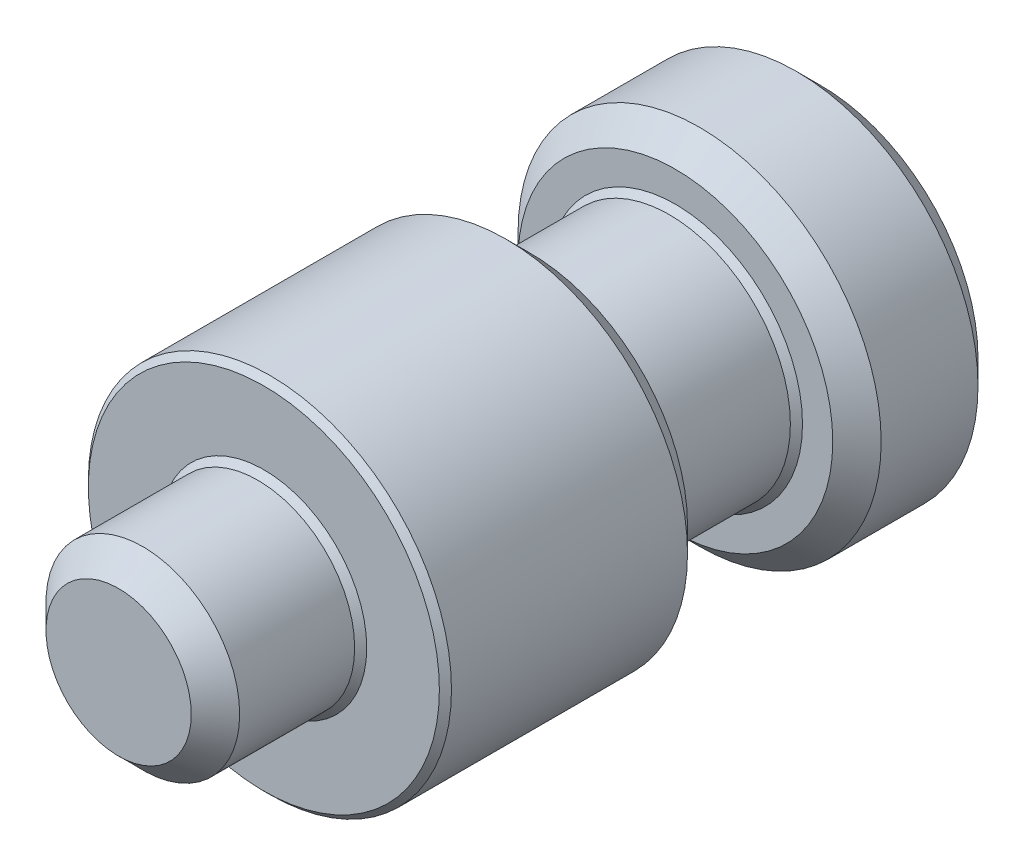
from build123d import *

# Parameters (mm, degrees)
SKETCH_1_R      = 7.5
EXTRUDE_1_DEPTH = 6
SKETCH_2_R      = 5
EXTRUDE_2_DEPTH = 6
SKETCH_3_R      = 7.5
EXTRUDE_3_DEPTH = 11
SKETCH_4_R      = 4
EXTRUDE_4_DEPTH = 6
CHAMFER_1_SIZE  = 1
CHAMFER_2_SIZE  = 0.25


with BuildPart() as part:
    # Sketch 1 → Extrude 1 (new body)
    with BuildSketch(Plane.XY):
        Circle(SKETCH_1_R)
    extrude(amount=EXTRUDE_1_DEPTH)

    # Sketch 2 → Extrude 2 (add)
    with BuildSketch(Plane.XY.offset(6)):
        Circle(SKETCH_2_R)
    extrude(amount=EXTRUDE_2_DEPTH)

    # Sketch 3 → Extrude 3 (add)
    with BuildSketch(Plane.XY.offset(12)):
        Circle(SKETCH_3_R)
    extrude(amount=EXTRUDE_3_DEPTH)

    # Sketch 4 → Extrude 4 (add)
    with BuildSketch(Plane.XY.offset(23)):
        Circle(SKETCH_4_R)
    extrude(amount=EXTRUDE_4_DEPTH)

    # Chamfer 1
    chamfer_1_edges = [part.edges().sort_by_distance(p)[0] for p in [
        (-4, 0, 29),
        (-7.5, 0, 0),
        (-7.5, 0, 6),
        (-7.5, 0, 12),
    ]]
    chamfer(chamfer_1_edges, length=CHAMFER_1_SIZE)

    # Chamfer 2
    chamfer_2_edges = [part.edges().sort_by_distance(p)[0] for p in [
        (-4, 0, 23),
        (-5, 0, 6),
        (-5, 0, 12),
        (-7.5, 0, 23),
    ]]
    chamfer(chamfer_2_edges, length=CHAMFER_2_SIZE)


solid = part.part
